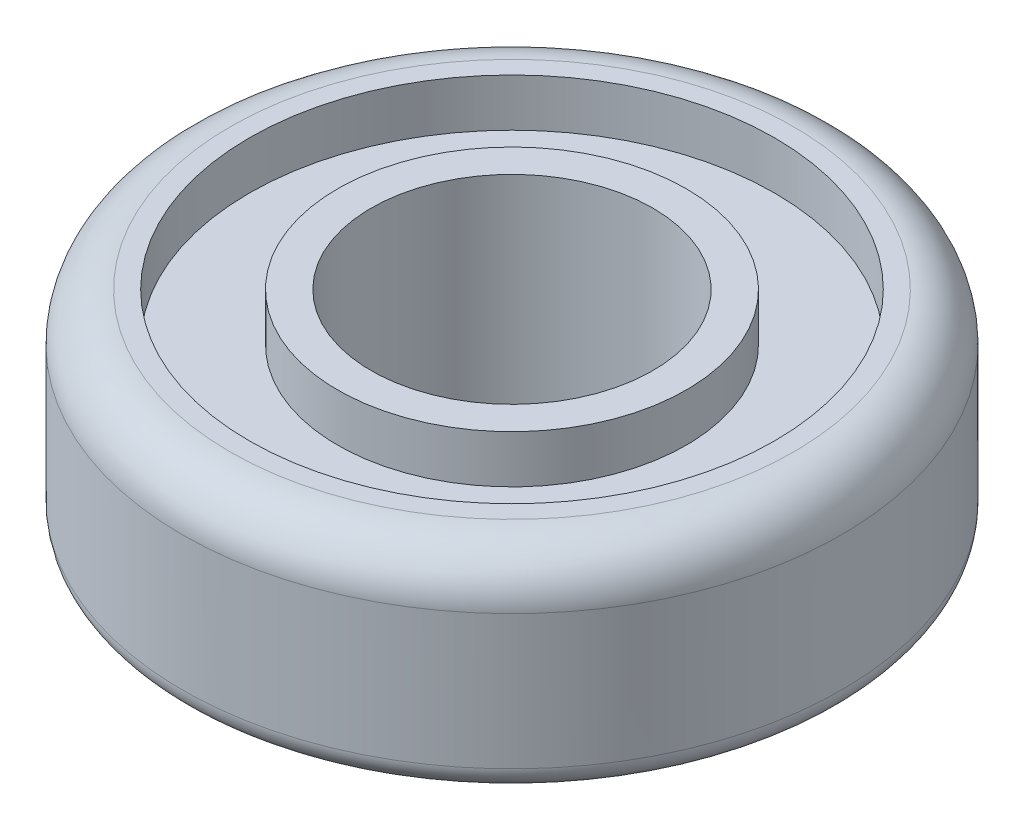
ISO-10303-21;
HEADER;
FILE_DESCRIPTION(('STEP AP214'),'2;1');
FILE_NAME('part.step','',(''),(''),'','','');
FILE_SCHEMA(('AUTOMOTIVE_DESIGN { 1 0 10303 214 1 1 1 1 }'));
ENDSEC;
DATA;
#1=APPLICATION_CONTEXT('core data for automotive mechanical design processes');
#2=APPLICATION_PROTOCOL_DEFINITION('international standard','automotive_design',2000,#1);
#3=PRODUCT_CONTEXT('',#1,'mechanical');
#4=PRODUCT('Part','Part','',(#3));
#5=PRODUCT_RELATED_PRODUCT_CATEGORY('part','',(#4));
#6=PRODUCT_DEFINITION_FORMATION('','',#4);
#7=PRODUCT_DEFINITION_CONTEXT('part definition',#1,'design');
#8=PRODUCT_DEFINITION('design','',#6,#7);
#9=PRODUCT_DEFINITION_SHAPE('','',#8);
#10=(LENGTH_UNIT() NAMED_UNIT(*) SI_UNIT(.MILLI.,.METRE.));
#11=(NAMED_UNIT(*) PLANE_ANGLE_UNIT() SI_UNIT($,.RADIAN.));
#12=(NAMED_UNIT(*) SI_UNIT($,.STERADIAN.) SOLID_ANGLE_UNIT());
#13=UNCERTAINTY_MEASURE_WITH_UNIT(LENGTH_MEASURE(1.E-05),#10,'distance_accuracy_value','');
#14=(GEOMETRIC_REPRESENTATION_CONTEXT(3) GLOBAL_UNCERTAINTY_ASSIGNED_CONTEXT((#13)) GLOBAL_UNIT_ASSIGNED_CONTEXT((#10,
#11,#12)) REPRESENTATION_CONTEXT('',''));
#15=CARTESIAN_POINT('',(0.,0.,0.));
#16=DIRECTION('',(0.,0.,1.));
#17=DIRECTION('',(1.,0.,0.));
#18=AXIS2_PLACEMENT_3D('',#15,#16,#17);
#19=CARTESIAN_POINT('',(7.4803,5.4737,0.));
#20=DIRECTION('',(0.,1.,0.));
#21=DIRECTION('',(0.,0.,1.));
#22=AXIS2_PLACEMENT_3D('',#19,#20,#21);
#23=PLANE('',#22);
#24=CARTESIAN_POINT('',(0.,5.4737,0.));
#25=DIRECTION('',(0.,-1.,0.));
#26=DIRECTION('',(0.,0.,-1.));
#27=AXIS2_PLACEMENT_3D('',#24,#25,#26);
#28=CIRCLE('',#27,7.4803);
#29=CARTESIAN_POINT('',(0.,5.4737,-7.4803));
#30=VERTEX_POINT('',#29);
#31=EDGE_CURVE('E72',#30,#30,#28,.T.);
#32=ORIENTED_EDGE('',*,*,#31,.T.);
#33=EDGE_LOOP('',(#32));
#34=FACE_BOUND('',#33,.T.);
#35=CARTESIAN_POINT('',(0.,5.4737,0.));
#36=DIRECTION('',(0.,-1.,0.));
#37=DIRECTION('',(0.,0.,-1.));
#38=AXIS2_PLACEMENT_3D('',#35,#36,#37);
#39=CIRCLE('',#38,9.2583);
#40=CARTESIAN_POINT('',(0.,5.4737,-9.2583));
#41=VERTEX_POINT('',#40);
#42=EDGE_CURVE('E45',#41,#41,#39,.T.);
#43=ORIENTED_EDGE('',*,*,#42,.F.);
#44=EDGE_LOOP('',(#43));
#45=FACE_BOUND('',#44,.T.);
#46=ADVANCED_FACE('F26',(#34,#45),#23,.T.);
#47=CARTESIAN_POINT('',(0.,0.,0.));
#48=DIRECTION('',(0.,-1.,0.));
#49=DIRECTION('',(0.,0.,-1.));
#50=AXIS2_PLACEMENT_3D('',#47,#48,#49);
#51=CYLINDRICAL_SURFACE('',#50,9.2583);
#52=ORIENTED_EDGE('',*,*,#42,.T.);
#53=EDGE_LOOP('',(#52));
#54=FACE_BOUND('',#53,.T.);
#55=CARTESIAN_POINT('',(0.,2.9337,0.));
#56=DIRECTION('',(0.,-1.,0.));
#57=DIRECTION('',(0.,0.,-1.));
#58=AXIS2_PLACEMENT_3D('',#55,#56,#57);
#59=CIRCLE('',#58,9.2583);
#60=CARTESIAN_POINT('',(0.,2.9337,-9.2583));
#61=VERTEX_POINT('',#60);
#62=EDGE_CURVE('E48',#61,#61,#59,.T.);
#63=ORIENTED_EDGE('',*,*,#62,.F.);
#64=EDGE_LOOP('',(#63));
#65=FACE_BOUND('',#64,.T.);
#66=ADVANCED_FACE('F95',(#54,#65),#51,.T.);
#67=CARTESIAN_POINT('',(9.2583,2.9337,0.));
#68=DIRECTION('',(0.,1.,0.));
#69=DIRECTION('',(0.,0.,1.));
#70=AXIS2_PLACEMENT_3D('',#67,#68,#69);
#71=PLANE('',#70);
#72=ORIENTED_EDGE('',*,*,#62,.T.);
#73=EDGE_LOOP('',(#72));
#74=FACE_BOUND('',#73,.T.);
#75=CARTESIAN_POINT('',(0.,2.9337,0.));
#76=DIRECTION('',(0.,-1.,0.));
#77=DIRECTION('',(0.,0.,-1.));
#78=AXIS2_PLACEMENT_3D('',#75,#76,#77);
#79=CIRCLE('',#78,13.9446);
#80=CARTESIAN_POINT('',(0.,2.9337,-13.9446));
#81=VERTEX_POINT('',#80);
#82=EDGE_CURVE('E51',#81,#81,#79,.T.);
#83=ORIENTED_EDGE('',*,*,#82,.F.);
#84=EDGE_LOOP('',(#83));
#85=FACE_BOUND('',#84,.T.);
#86=ADVANCED_FACE('F99',(#74,#85),#71,.T.);
#87=CARTESIAN_POINT('',(0.,0.,0.));
#88=DIRECTION('',(0.,-1.,0.));
#89=DIRECTION('',(0.,0.,-1.));
#90=AXIS2_PLACEMENT_3D('',#87,#88,#89);
#91=CYLINDRICAL_SURFACE('',#90,13.9446);
#92=ORIENTED_EDGE('',*,*,#82,.T.);
#93=EDGE_LOOP('',(#92));
#94=FACE_BOUND('',#93,.T.);
#95=CARTESIAN_POINT('',(0.,5.4737,0.));
#96=DIRECTION('',(0.,-1.,0.));
#97=DIRECTION('',(0.,0.,-1.));
#98=AXIS2_PLACEMENT_3D('',#95,#96,#97);
#99=CIRCLE('',#98,13.9446);
#100=CARTESIAN_POINT('',(0.,5.4737,-13.9446));
#101=VERTEX_POINT('',#100);
#102=EDGE_CURVE('E54',#101,#101,#99,.T.);
#103=ORIENTED_EDGE('',*,*,#102,.F.);
#104=EDGE_LOOP('',(#103));
#105=FACE_BOUND('',#104,.T.);
#106=ADVANCED_FACE('F104',(#94,#105),#91,.F.);
#107=CARTESIAN_POINT('',(13.9446,5.4737,0.));
#108=DIRECTION('',(0.,1.,0.));
#109=DIRECTION('',(0.,0.,1.));
#110=AXIS2_PLACEMENT_3D('',#107,#108,#109);
#111=PLANE('',#110);
#112=CARTESIAN_POINT('',(0.,5.4737,0.));
#113=DIRECTION('',(0.,1.,0.));
#114=DIRECTION('',(0.,0.,1.));
#115=AXIS2_PLACEMENT_3D('',#112,#113,#114);
#116=CIRCLE('',#115,14.9606);
#117=CARTESIAN_POINT('',(0.,5.4737,14.9606));
#118=VERTEX_POINT('',#117);
#119=EDGE_CURVE('E36',#118,#118,#116,.T.);
#120=ORIENTED_EDGE('',*,*,#119,.T.);
#121=EDGE_LOOP('',(#120));
#122=FACE_BOUND('',#121,.T.);
#123=ORIENTED_EDGE('',*,*,#102,.T.);
#124=EDGE_LOOP('',(#123));
#125=FACE_BOUND('',#124,.T.);
#126=ADVANCED_FACE('F111',(#122,#125),#111,.T.);
#127=CARTESIAN_POINT('',(0.,0.,0.));
#128=DIRECTION('',(0.,-1.,0.));
#129=DIRECTION('',(0.,0.,-1.));
#130=AXIS2_PLACEMENT_3D('',#127,#128,#129);
#131=CYLINDRICAL_SURFACE('',#130,17.5006);
#132=CARTESIAN_POINT('',(0.,-4.2037,0.));
#133=DIRECTION('',(0.,-1.,0.));
#134=DIRECTION('',(0.,0.,-1.));
#135=AXIS2_PLACEMENT_3D('',#132,#133,#134);
#136=CIRCLE('',#135,17.5006);
#137=CARTESIAN_POINT('',(0.,-4.2037,-17.5006));
#138=VERTEX_POINT('',#137);
#139=EDGE_CURVE('E10',#138,#138,#136,.F.);
#140=ORIENTED_EDGE('',*,*,#139,.T.);
#141=EDGE_LOOP('',(#140));
#142=FACE_BOUND('',#141,.T.);
#143=CARTESIAN_POINT('',(0.,2.9337,0.));
#144=DIRECTION('',(0.,1.,0.));
#145=DIRECTION('',(0.,0.,1.));
#146=AXIS2_PLACEMENT_3D('',#143,#144,#145);
#147=CIRCLE('',#146,17.5006);
#148=CARTESIAN_POINT('',(0.,2.9337,17.5006));
#149=VERTEX_POINT('',#148);
#150=EDGE_CURVE('E40',#149,#149,#147,.F.);
#151=ORIENTED_EDGE('',*,*,#150,.T.);
#152=EDGE_LOOP('',(#151));
#153=FACE_BOUND('',#152,.T.);
#154=ADVANCED_FACE('F115',(#142,#153),#131,.T.);
#155=CARTESIAN_POINT('',(13.9446,-5.4737,0.));
#156=DIRECTION('',(0.,-1.,0.));
#157=DIRECTION('',(0.,0.,-1.));
#158=AXIS2_PLACEMENT_3D('',#155,#156,#157);
#159=PLANE('',#158);
#160=CARTESIAN_POINT('',(0.,-5.4737,0.));
#161=DIRECTION('',(0.,-1.,0.));
#162=DIRECTION('',(0.,0.,-1.));
#163=AXIS2_PLACEMENT_3D('',#160,#161,#162);
#164=CIRCLE('',#163,16.2306);
#165=CARTESIAN_POINT('',(0.,-5.4737,-16.2306));
#166=VERTEX_POINT('',#165);
#167=EDGE_CURVE('E32',#166,#166,#164,.T.);
#168=ORIENTED_EDGE('',*,*,#167,.T.);
#169=EDGE_LOOP('',(#168));
#170=FACE_BOUND('',#169,.T.);
#171=CARTESIAN_POINT('',(0.,-5.4737,0.));
#172=DIRECTION('',(0.,-1.,0.));
#173=DIRECTION('',(0.,0.,-1.));
#174=AXIS2_PLACEMENT_3D('',#171,#172,#173);
#175=CIRCLE('',#174,13.9446);
#176=CARTESIAN_POINT('',(0.,-5.4737,-13.9446));
#177=VERTEX_POINT('',#176);
#178=EDGE_CURVE('E57',#177,#177,#175,.T.);
#179=ORIENTED_EDGE('',*,*,#178,.F.);
#180=EDGE_LOOP('',(#179));
#181=FACE_BOUND('',#180,.T.);
#182=ADVANCED_FACE('F119',(#170,#181),#159,.T.);
#183=CARTESIAN_POINT('',(0.,0.,0.));
#184=DIRECTION('',(0.,-1.,0.));
#185=DIRECTION('',(0.,0.,-1.));
#186=AXIS2_PLACEMENT_3D('',#183,#184,#185);
#187=CYLINDRICAL_SURFACE('',#186,13.9446);
#188=ORIENTED_EDGE('',*,*,#178,.T.);
#189=EDGE_LOOP('',(#188));
#190=FACE_BOUND('',#189,.T.);
#191=CARTESIAN_POINT('',(0.,-2.9337,0.));
#192=DIRECTION('',(0.,-1.,0.));
#193=DIRECTION('',(0.,0.,-1.));
#194=AXIS2_PLACEMENT_3D('',#191,#192,#193);
#195=CIRCLE('',#194,13.9446);
#196=CARTESIAN_POINT('',(0.,-2.9337,-13.9446));
#197=VERTEX_POINT('',#196);
#198=EDGE_CURVE('E60',#197,#197,#195,.T.);
#199=ORIENTED_EDGE('',*,*,#198,.F.);
#200=EDGE_LOOP('',(#199));
#201=FACE_BOUND('',#200,.T.);
#202=ADVANCED_FACE('F122',(#190,#201),#187,.F.);
#203=CARTESIAN_POINT('',(9.2583,-2.9337,0.));
#204=DIRECTION('',(0.,-1.,0.));
#205=DIRECTION('',(0.,0.,-1.));
#206=AXIS2_PLACEMENT_3D('',#203,#204,#205);
#207=PLANE('',#206);
#208=ORIENTED_EDGE('',*,*,#198,.T.);
#209=EDGE_LOOP('',(#208));
#210=FACE_BOUND('',#209,.T.);
#211=CARTESIAN_POINT('',(0.,-2.9337,0.));
#212=DIRECTION('',(0.,-1.,0.));
#213=DIRECTION('',(0.,0.,-1.));
#214=AXIS2_PLACEMENT_3D('',#211,#212,#213);
#215=CIRCLE('',#214,9.2583);
#216=CARTESIAN_POINT('',(0.,-2.9337,-9.2583));
#217=VERTEX_POINT('',#216);
#218=EDGE_CURVE('E63',#217,#217,#215,.T.);
#219=ORIENTED_EDGE('',*,*,#218,.F.);
#220=EDGE_LOOP('',(#219));
#221=FACE_BOUND('',#220,.T.);
#222=ADVANCED_FACE('F125',(#210,#221),#207,.T.);
#223=CARTESIAN_POINT('',(0.,0.,0.));
#224=DIRECTION('',(0.,-1.,0.));
#225=DIRECTION('',(0.,0.,-1.));
#226=AXIS2_PLACEMENT_3D('',#223,#224,#225);
#227=CYLINDRICAL_SURFACE('',#226,9.2583);
#228=ORIENTED_EDGE('',*,*,#218,.T.);
#229=EDGE_LOOP('',(#228));
#230=FACE_BOUND('',#229,.T.);
#231=CARTESIAN_POINT('',(0.,-5.4737,0.));
#232=DIRECTION('',(0.,-1.,0.));
#233=DIRECTION('',(0.,0.,-1.));
#234=AXIS2_PLACEMENT_3D('',#231,#232,#233);
#235=CIRCLE('',#234,9.2583);
#236=CARTESIAN_POINT('',(0.,-5.4737,-9.2583));
#237=VERTEX_POINT('',#236);
#238=EDGE_CURVE('E66',#237,#237,#235,.T.);
#239=ORIENTED_EDGE('',*,*,#238,.F.);
#240=EDGE_LOOP('',(#239));
#241=FACE_BOUND('',#240,.T.);
#242=ADVANCED_FACE('F91',(#230,#241),#227,.T.);
#243=CARTESIAN_POINT('',(7.4803,-5.4737,0.));
#244=DIRECTION('',(0.,-1.,0.));
#245=DIRECTION('',(0.,0.,-1.));
#246=AXIS2_PLACEMENT_3D('',#243,#244,#245);
#247=PLANE('',#246);
#248=ORIENTED_EDGE('',*,*,#238,.T.);
#249=EDGE_LOOP('',(#248));
#250=FACE_BOUND('',#249,.T.);
#251=CARTESIAN_POINT('',(0.,-5.4737,0.));
#252=DIRECTION('',(0.,-1.,0.));
#253=DIRECTION('',(0.,0.,-1.));
#254=AXIS2_PLACEMENT_3D('',#251,#252,#253);
#255=CIRCLE('',#254,7.4803);
#256=CARTESIAN_POINT('',(0.,-5.4737,-7.4803));
#257=VERTEX_POINT('',#256);
#258=EDGE_CURVE('E69',#257,#257,#255,.T.);
#259=ORIENTED_EDGE('',*,*,#258,.F.);
#260=EDGE_LOOP('',(#259));
#261=FACE_BOUND('',#260,.T.);
#262=ADVANCED_FACE('F81',(#250,#261),#247,.T.);
#263=CARTESIAN_POINT('',(0.,0.,0.));
#264=DIRECTION('',(0.,-1.,0.));
#265=DIRECTION('',(0.,0.,-1.));
#266=AXIS2_PLACEMENT_3D('',#263,#264,#265);
#267=CYLINDRICAL_SURFACE('',#266,7.4803);
#268=ORIENTED_EDGE('',*,*,#258,.T.);
#269=EDGE_LOOP('',(#268));
#270=FACE_BOUND('',#269,.T.);
#271=ORIENTED_EDGE('',*,*,#31,.F.);
#272=EDGE_LOOP('',(#271));
#273=FACE_BOUND('',#272,.T.);
#274=ADVANCED_FACE('F78',(#270,#273),#267,.F.);
#275=CARTESIAN_POINT('',(0.,2.9337,0.));
#276=DIRECTION('',(0.,1.,0.));
#277=DIRECTION('',(0.,0.,1.));
#278=AXIS2_PLACEMENT_3D('',#275,#276,#277);
#279=TOROIDAL_SURFACE('',#278,14.9606,2.54);
#280=ORIENTED_EDGE('',*,*,#119,.F.);
#281=EDGE_LOOP('',(#280));
#282=FACE_BOUND('',#281,.T.);
#283=ORIENTED_EDGE('',*,*,#150,.F.);
#284=EDGE_LOOP('',(#283));
#285=FACE_BOUND('',#284,.T.);
#286=ADVANCED_FACE('F80',(#282,#285),#279,.T.);
#287=CARTESIAN_POINT('',(0.,-4.2037,0.));
#288=DIRECTION('',(0.,-1.,0.));
#289=DIRECTION('',(0.,0.,-1.));
#290=AXIS2_PLACEMENT_3D('',#287,#288,#289);
#291=TOROIDAL_SURFACE('',#290,16.2306,1.27);
#292=ORIENTED_EDGE('',*,*,#139,.F.);
#293=EDGE_LOOP('',(#292));
#294=FACE_BOUND('',#293,.T.);
#295=ORIENTED_EDGE('',*,*,#167,.F.);
#296=EDGE_LOOP('',(#295));
#297=FACE_BOUND('',#296,.T.);
#298=ADVANCED_FACE('F88',(#294,#297),#291,.T.);
#299=CLOSED_SHELL('',(#46,#66,#86,#106,#126,#154,#182,#202,#222,#242,#262,#274,#286,#298));
#300=MANIFOLD_SOLID_BREP('B2',#299);
#301=ADVANCED_BREP_SHAPE_REPRESENTATION('',(#18,#300),#14);
#302=SHAPE_DEFINITION_REPRESENTATION(#9,#301);
ENDSEC;
END-ISO-10303-21;
